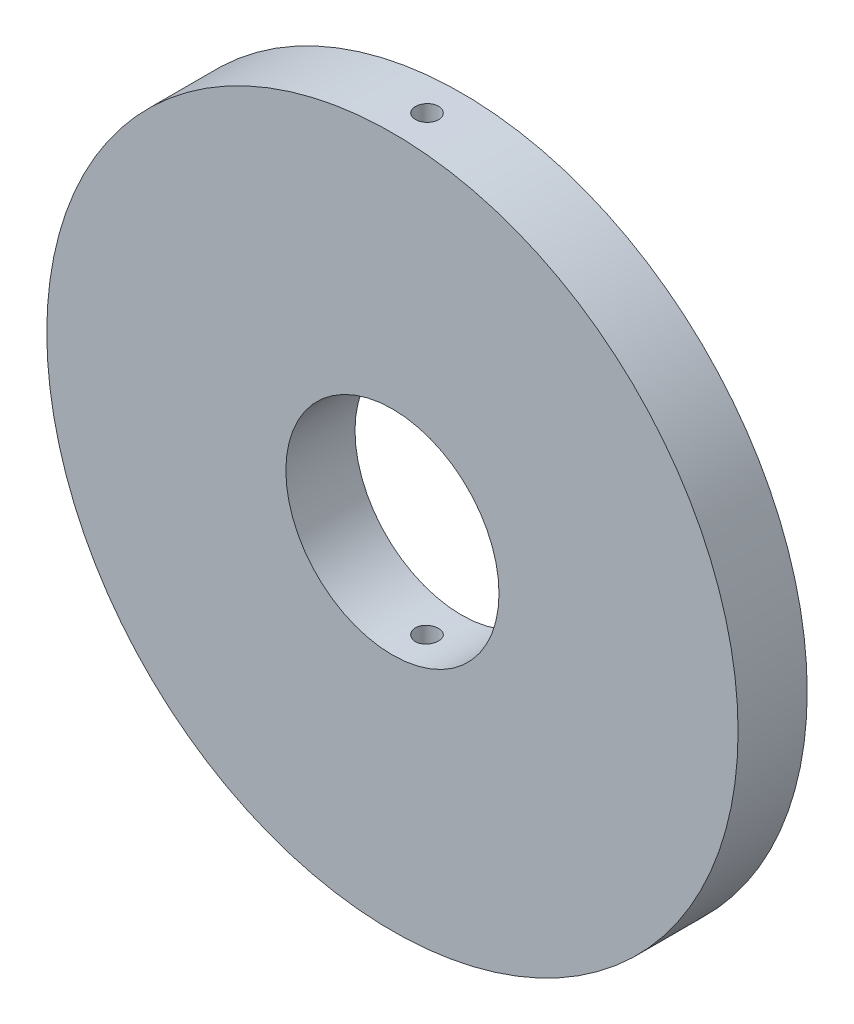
from build123d import *

# Parameters (mm, degrees)
SKETCH1_R               = 60
SKETCH1_R_2             = 18.5
BOSS_EXTRUDE1_DEPTH     = 6
CUT_EXTRUDE1_DEPTH      = 86.064681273
CUT_EXTRUDE1_DEPTH_BACK = 86.064681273
SKETCH2_R               = 2


with BuildPart() as part:
    # Sketch1 → Boss-Extrude1 (new, symmetric)
    with BuildSketch(Plane.XY):
        Circle(SKETCH1_R)
        Circle(SKETCH1_R_2, mode=Mode.SUBTRACT)
    extrude(amount=BOSS_EXTRUDE1_DEPTH, both=True)

    # Sketch2 → Cut-Extrude1 (cut, two sides: drawn at the far end of the back side and taken through both)
    with BuildSketch(Plane(origin=(0, 0, 0), x_dir=(1, 0, 0), z_dir=(0, 1, 0)).offset(-CUT_EXTRUDE1_DEPTH_BACK)):
        with Locations(Location((0, 0, 0), (0, 0, 270))):
            Circle(SKETCH2_R)
    extrude(amount=CUT_EXTRUDE1_DEPTH + CUT_EXTRUDE1_DEPTH_BACK, mode=Mode.SUBTRACT)


solid = part.part
